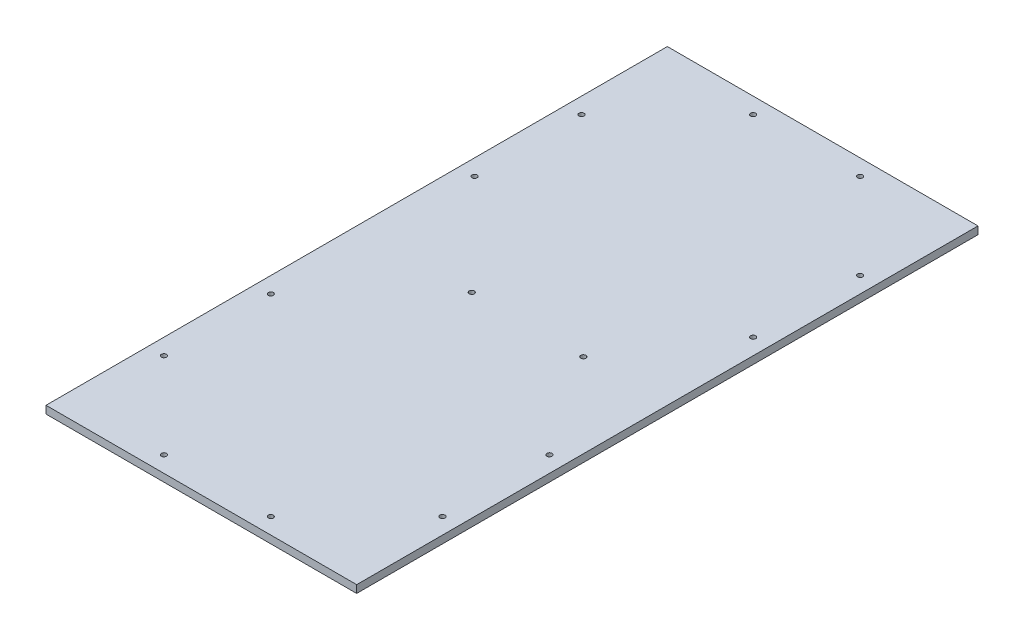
from build123d import *

# Parameters (mm, degrees)
SKETCH1_W           = 610
SKETCH1_H           = 1220
BOSS_EXTRUDE1_DEPTH = 15
CUT_EXTRUDE1_REACH  = 1366.084
SKETCH2_R           = 5


with BuildPart() as part:
    # Sketch1 → Boss-Extrude1 (new body)
    with BuildSketch(Plane(origin=(0, 0, 0), x_dir=(1, 0, 0), z_dir=(0, 1, 0))):
        with Locations((305, 610)):
            Rectangle(SKETCH1_W, SKETCH1_H)
    extrude(amount=BOSS_EXTRUDE1_DEPTH)

    # Sketch2 → Cut-Extrude1 (cut, up to next)
    with BuildSketch(Plane(origin=(0, 15, 0), x_dir=(1, 0, 0), z_dir=(0, 1, 0)), mode=Mode.PRIVATE) as cut_extrude1_sk1:
        with Locations(Location((578.5, 200, 0), (0, 0, 270))):
            Circle(SKETCH2_R)
    cut_extrude1_tool1 = extrude(cut_extrude1_sk1.sketch, amount=-CUT_EXTRUDE1_REACH, mode=Mode.PRIVATE) & part.part
    # Sketch2 → Cut-Extrude1 (cut, up to next)
    with BuildSketch(Plane(origin=(0, 15, 0), x_dir=(1, 0, 0), z_dir=(0, 1, 0)), mode=Mode.PRIVATE) as cut_extrude1_sk2:
        with Locations(Location((200, 31.5, 0), (0, 0, 270))):
            Circle(SKETCH2_R)
    cut_extrude1_tool2 = extrude(cut_extrude1_sk2.sketch, amount=-CUT_EXTRUDE1_REACH, mode=Mode.PRIVATE) & part.part
    # Sketch2 → Cut-Extrude1 (cut, up to next)
    with BuildSketch(Plane(origin=(0, 15, 0), x_dir=(1, 0, 0), z_dir=(0, 1, 0)), mode=Mode.PRIVATE) as cut_extrude1_sk3:
        with Locations(Location((410, 31.5, 0), (0, 0, 270))):
            Circle(SKETCH2_R)
    cut_extrude1_tool3 = extrude(cut_extrude1_sk3.sketch, amount=-CUT_EXTRUDE1_REACH, mode=Mode.PRIVATE) & part.part
    # Sketch2 → Cut-Extrude1 (cut, up to next)
    with BuildSketch(Plane(origin=(0, 15, 0), x_dir=(1, 0, 0), z_dir=(0, 1, 0)), mode=Mode.PRIVATE) as cut_extrude1_sk4:
        with Locations(Location((31.5, 200, 0), (0, 0, 270))):
            Circle(SKETCH2_R)
    cut_extrude1_tool4 = extrude(cut_extrude1_sk4.sketch, amount=-CUT_EXTRUDE1_REACH, mode=Mode.PRIVATE) & part.part
    # Sketch2 → Cut-Extrude1 (cut, up to next)
    with BuildSketch(Plane(origin=(0, 15, 0), x_dir=(1, 0, 0), z_dir=(0, 1, 0)), mode=Mode.PRIVATE) as cut_extrude1_sk5:
        with Locations(Location((31.5, 410, 0), (0, 0, 270))):
            Circle(SKETCH2_R)
    cut_extrude1_tool5 = extrude(cut_extrude1_sk5.sketch, amount=-CUT_EXTRUDE1_REACH, mode=Mode.PRIVATE) & part.part
    # Sketch2 → Cut-Extrude1 (cut, up to next)
    with BuildSketch(Plane(origin=(0, 15, 0), x_dir=(1, 0, 0), z_dir=(0, 1, 0)), mode=Mode.PRIVATE) as cut_extrude1_sk6:
        with Locations(Location((31.5, 810, 0), (0, 0, 270))):
            Circle(SKETCH2_R)
    cut_extrude1_tool6 = extrude(cut_extrude1_sk6.sketch, amount=-CUT_EXTRUDE1_REACH, mode=Mode.PRIVATE) & part.part
    # Sketch2 → Cut-Extrude1 (cut, up to next)
    with BuildSketch(Plane(origin=(0, 15, 0), x_dir=(1, 0, 0), z_dir=(0, 1, 0)), mode=Mode.PRIVATE) as cut_extrude1_sk7:
        with Locations(Location((31.5, 1020, 0), (0, 0, 270))):
            Circle(SKETCH2_R)
    cut_extrude1_tool7 = extrude(cut_extrude1_sk7.sketch, amount=-CUT_EXTRUDE1_REACH, mode=Mode.PRIVATE) & part.part
    # Sketch2 → Cut-Extrude1 (cut, up to next)
    with BuildSketch(Plane(origin=(0, 15, 0), x_dir=(1, 0, 0), z_dir=(0, 1, 0)), mode=Mode.PRIVATE) as cut_extrude1_sk8:
        with Locations(Location((200, 1188.5, 0), (0, 0, 270))):
            Circle(SKETCH2_R)
    cut_extrude1_tool8 = extrude(cut_extrude1_sk8.sketch, amount=-CUT_EXTRUDE1_REACH, mode=Mode.PRIVATE) & part.part
    # Sketch2 → Cut-Extrude1 (cut, up to next)
    with BuildSketch(Plane(origin=(0, 15, 0), x_dir=(1, 0, 0), z_dir=(0, 1, 0)), mode=Mode.PRIVATE) as cut_extrude1_sk9:
        with Locations(Location((410, 1188.5, 0), (0, 0, 270))):
            Circle(SKETCH2_R)
    cut_extrude1_tool9 = extrude(cut_extrude1_sk9.sketch, amount=-CUT_EXTRUDE1_REACH, mode=Mode.PRIVATE) & part.part
    # Sketch2 → Cut-Extrude1 (cut, up to next)
    with BuildSketch(Plane(origin=(0, 15, 0), x_dir=(1, 0, 0), z_dir=(0, 1, 0)), mode=Mode.PRIVATE) as cut_extrude1_sk10:
        with Locations(Location((578.5, 1020, 0), (0, 0, 270))):
            Circle(SKETCH2_R)
    cut_extrude1_tool10 = extrude(cut_extrude1_sk10.sketch, amount=-CUT_EXTRUDE1_REACH, mode=Mode.PRIVATE) & part.part
    # Sketch2 → Cut-Extrude1 (cut, up to next)
    with BuildSketch(Plane(origin=(0, 15, 0), x_dir=(1, 0, 0), z_dir=(0, 1, 0)), mode=Mode.PRIVATE) as cut_extrude1_sk11:
        with Locations(Location((578.5, 810, 0), (0, 0, 270))):
            Circle(SKETCH2_R)
    cut_extrude1_tool11 = extrude(cut_extrude1_sk11.sketch, amount=-CUT_EXTRUDE1_REACH, mode=Mode.PRIVATE) & part.part
    # Sketch2 → Cut-Extrude1 (cut, up to next)
    with BuildSketch(Plane(origin=(0, 15, 0), x_dir=(1, 0, 0), z_dir=(0, 1, 0)), mode=Mode.PRIVATE) as cut_extrude1_sk12:
        with Locations(Location((578.5, 410, 0), (0, 0, 270))):
            Circle(SKETCH2_R)
    cut_extrude1_tool12 = extrude(cut_extrude1_sk12.sketch, amount=-CUT_EXTRUDE1_REACH, mode=Mode.PRIVATE) & part.part
    # Sketch2 → Cut-Extrude1 (cut, up to next)
    with BuildSketch(Plane(origin=(0, 15, 0), x_dir=(1, 0, 0), z_dir=(0, 1, 0)), mode=Mode.PRIVATE) as cut_extrude1_sk13:
        with Locations(Location((226, 610, 0), (0, 0, 270))):
            Circle(SKETCH2_R)
    cut_extrude1_tool13 = extrude(cut_extrude1_sk13.sketch, amount=-CUT_EXTRUDE1_REACH, mode=Mode.PRIVATE) & part.part
    # Sketch2 → Cut-Extrude1 (cut, up to next)
    with BuildSketch(Plane(origin=(0, 15, 0), x_dir=(1, 0, 0), z_dir=(0, 1, 0)), mode=Mode.PRIVATE) as cut_extrude1_sk14:
        with Locations(Location((445, 610, 0), (0, 0, 270))):
            Circle(SKETCH2_R)
    cut_extrude1_tool14 = extrude(cut_extrude1_sk14.sketch, amount=-CUT_EXTRUDE1_REACH, mode=Mode.PRIVATE) & part.part
    add(cut_extrude1_tool1.solids().sort_by_distance((578.5, 15, -200))[0], mode=Mode.SUBTRACT)
    add(cut_extrude1_tool2.solids().sort_by_distance((200, 15, -31.5))[0], mode=Mode.SUBTRACT)
    add(cut_extrude1_tool3.solids().sort_by_distance((410, 15, -31.5))[0], mode=Mode.SUBTRACT)
    add(cut_extrude1_tool4.solids().sort_by_distance((31.5, 15, -200))[0], mode=Mode.SUBTRACT)
    add(cut_extrude1_tool5.solids().sort_by_distance((31.5, 15, -410))[0], mode=Mode.SUBTRACT)
    add(cut_extrude1_tool6.solids().sort_by_distance((31.5, 15, -810))[0], mode=Mode.SUBTRACT)
    add(cut_extrude1_tool7.solids().sort_by_distance((31.5, 15, -1020))[0], mode=Mode.SUBTRACT)
    add(cut_extrude1_tool8.solids().sort_by_distance((200, 15, -1188.5))[0], mode=Mode.SUBTRACT)
    add(cut_extrude1_tool9.solids().sort_by_distance((410, 15, -1188.5))[0], mode=Mode.SUBTRACT)
    add(cut_extrude1_tool10.solids().sort_by_distance((578.5, 15, -1020))[0], mode=Mode.SUBTRACT)
    add(cut_extrude1_tool11.solids().sort_by_distance((578.5, 15, -810))[0], mode=Mode.SUBTRACT)
    add(cut_extrude1_tool12.solids().sort_by_distance((578.5, 15, -410))[0], mode=Mode.SUBTRACT)
    add(cut_extrude1_tool13.solids().sort_by_distance((226, 15, -610))[0], mode=Mode.SUBTRACT)
    add(cut_extrude1_tool14.solids().sort_by_distance((445, 15, -610))[0], mode=Mode.SUBTRACT)


solid = part.part
